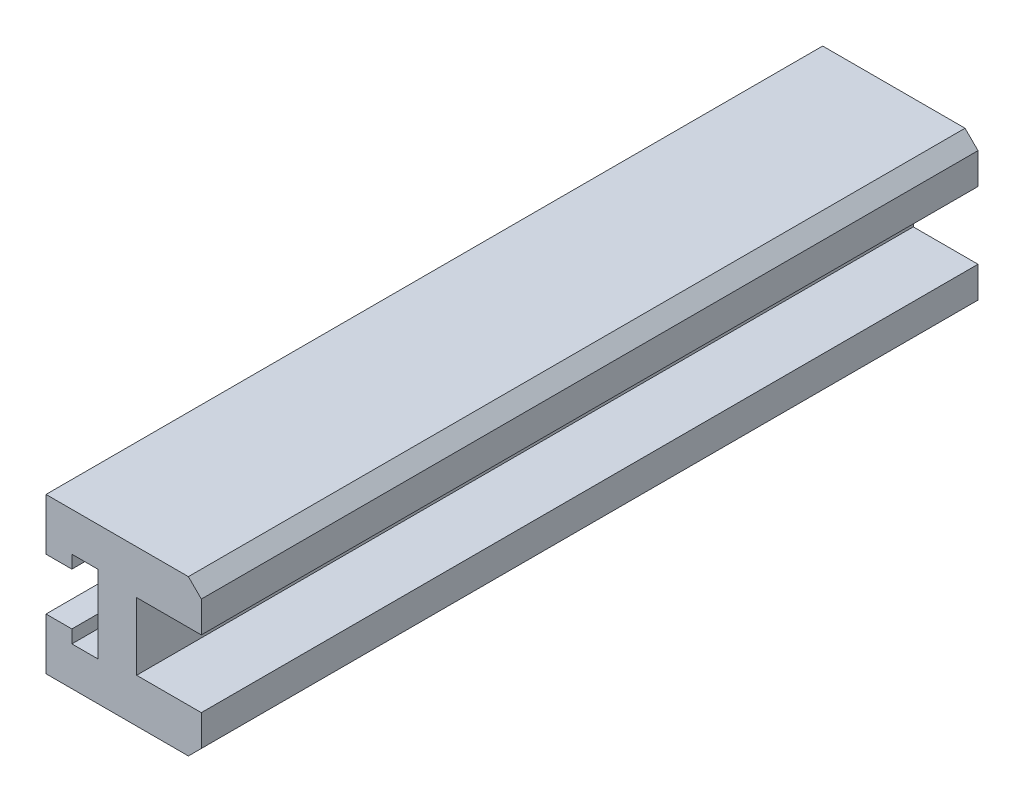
from build123d import *

# Parameters (mm, degrees)
BOSS_EXTRUDE1_DEPTH = 30
SKETCH2_R           = 1.5
CUT_EXTRUDE1_DEPTH  = 32
CHAMFER1_SIZE       = 1
BOSS_EXTRUDE2_DEPTH = 60


with BuildPart() as part:
    # Sketch1 → Boss-Extrude1 (new, symmetric)
    with BuildSketch(Plane.XY):
        Polygon((-1, -2.6), (-1, 2.6), (4, 2.6), (4, 6), (-4, 6), (-4, -6), (4, -6), (4, -2.6), align=None)
    extrude(amount=BOSS_EXTRUDE1_DEPTH, both=True)

    # Sketch2 → Cut-Extrude1 (cut, through all)
    with BuildSketch(Plane(origin=(-1, 0, 0), x_dir=(0, 0, -1), z_dir=(1, 0, 0))):
        with Locations(Location((-15, 0, 0), (0, 0, 90))):
            Circle(SKETCH2_R)
        with Locations(Location((15, 0, 0), (0, 0, 270))):
            Circle(SKETCH2_R)
    extrude(amount=-CUT_EXTRUDE1_DEPTH, mode=Mode.SUBTRACT)

    # Chamfer1
    chamfer1_edges = [part.edges().sort_by_distance(p)[0] for p in [
        (4, -6, 0),
        (4, 6, 0),
    ]]
    chamfer(chamfer1_edges, length=CHAMFER1_SIZE)

    # Sketch3 → Boss-Extrude2 (add)
    with BuildSketch(Plane(origin=(0, 0, -30), x_dir=(-1, 0, 0), z_dir=(0, 0, -1))):
        Polygon((4, 6), (8, 6), (8, 2), (6, 2), (6, 3), (4, 3), align=None)
        Polygon((4, -3), (4, -6), (8, -6), (8, -2), (6, -2), (6, -3), align=None)
    extrude(amount=-BOSS_EXTRUDE2_DEPTH)


solid = part.part
